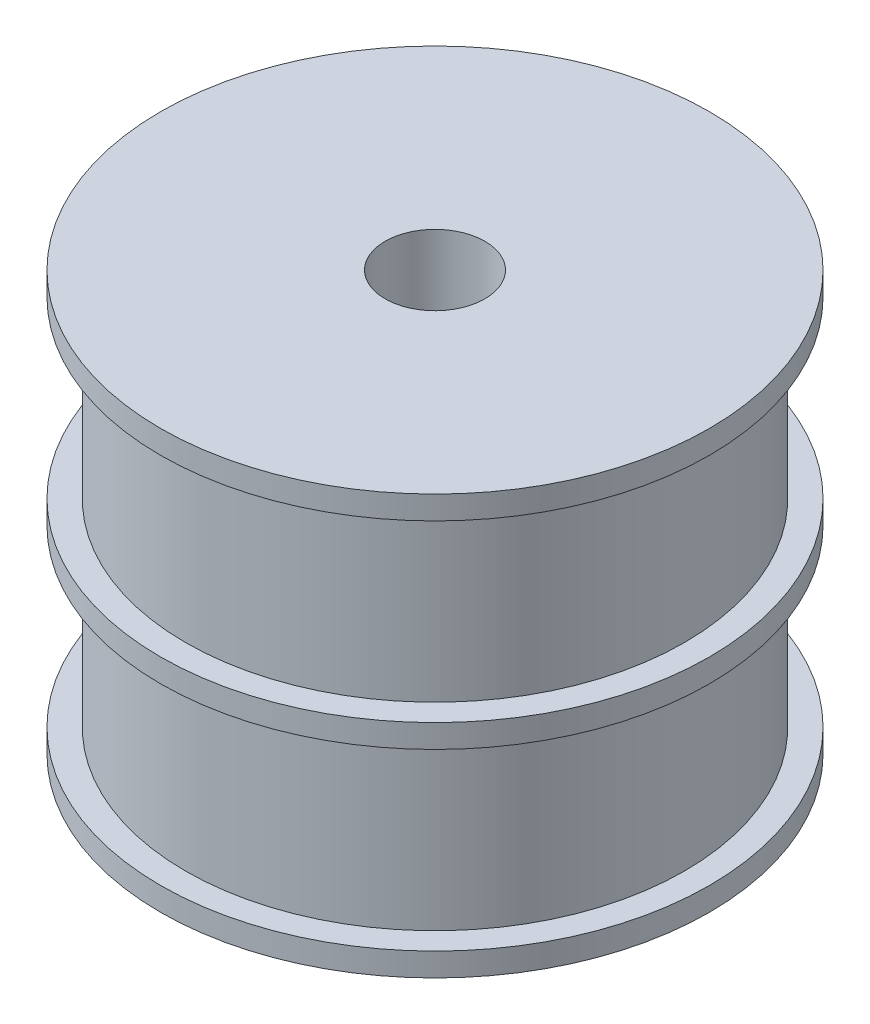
ISO-10303-21;
HEADER;
FILE_DESCRIPTION(('STEP AP214'),'2;1');
FILE_NAME('part.step','',(''),(''),'','','');
FILE_SCHEMA(('AUTOMOTIVE_DESIGN { 1 0 10303 214 1 1 1 1 }'));
ENDSEC;
DATA;
#1=APPLICATION_CONTEXT('core data for automotive mechanical design processes');
#2=APPLICATION_PROTOCOL_DEFINITION('international standard','automotive_design',2000,#1);
#3=PRODUCT_CONTEXT('',#1,'mechanical');
#4=PRODUCT('Part','Part','',(#3));
#5=PRODUCT_RELATED_PRODUCT_CATEGORY('part','',(#4));
#6=PRODUCT_DEFINITION_FORMATION('','',#4);
#7=PRODUCT_DEFINITION_CONTEXT('part definition',#1,'design');
#8=PRODUCT_DEFINITION('design','',#6,#7);
#9=PRODUCT_DEFINITION_SHAPE('','',#8);
#10=(LENGTH_UNIT() NAMED_UNIT(*) SI_UNIT(.MILLI.,.METRE.));
#11=(NAMED_UNIT(*) PLANE_ANGLE_UNIT() SI_UNIT($,.RADIAN.));
#12=(NAMED_UNIT(*) SI_UNIT($,.STERADIAN.) SOLID_ANGLE_UNIT());
#13=UNCERTAINTY_MEASURE_WITH_UNIT(LENGTH_MEASURE(1.E-05),#10,'distance_accuracy_value','');
#14=(GEOMETRIC_REPRESENTATION_CONTEXT(3) GLOBAL_UNCERTAINTY_ASSIGNED_CONTEXT((#13)) GLOBAL_UNIT_ASSIGNED_CONTEXT((#10,
#11,#12)) REPRESENTATION_CONTEXT('',''));
#15=CARTESIAN_POINT('',(0.,0.,0.));
#16=DIRECTION('',(0.,0.,1.));
#17=DIRECTION('',(1.,0.,0.));
#18=AXIS2_PLACEMENT_3D('',#15,#16,#17);
#19=CARTESIAN_POINT('',(0.,0.,0.));
#20=DIRECTION('',(0.,-1.,0.));
#21=DIRECTION('',(0.,0.,-1.));
#22=AXIS2_PLACEMENT_3D('',#19,#20,#21);
#23=CYLINDRICAL_SURFACE('',#22,5.5);
#24=CARTESIAN_POINT('',(0.,8.4,0.));
#25=DIRECTION('',(0.,-1.,0.));
#26=DIRECTION('',(0.,0.,-1.));
#27=AXIS2_PLACEMENT_3D('',#24,#25,#26);
#28=CIRCLE('',#27,5.5);
#29=CARTESIAN_POINT('',(0.,8.4,-5.5));
#30=VERTEX_POINT('',#29);
#31=EDGE_CURVE('E94',#30,#30,#28,.T.);
#32=ORIENTED_EDGE('',*,*,#31,.T.);
#33=EDGE_LOOP('',(#32));
#34=FACE_BOUND('',#33,.T.);
#35=CARTESIAN_POINT('',(0.,7.93333333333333,0.));
#36=DIRECTION('',(0.,-1.,0.));
#37=DIRECTION('',(0.,0.,-1.));
#38=AXIS2_PLACEMENT_3D('',#35,#36,#37);
#39=CIRCLE('',#38,5.5);
#40=CARTESIAN_POINT('',(0.,7.93333333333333,-5.5));
#41=VERTEX_POINT('',#40);
#42=EDGE_CURVE('E10',#41,#41,#39,.T.);
#43=ORIENTED_EDGE('',*,*,#42,.F.);
#44=EDGE_LOOP('',(#43));
#45=FACE_BOUND('',#44,.T.);
#46=ADVANCED_FACE('F43',(#34,#45),#23,.T.);
#47=CARTESIAN_POINT('',(5.5,7.93333333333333,0.));
#48=DIRECTION('',(0.,-1.,0.));
#49=DIRECTION('',(0.,0.,-1.));
#50=AXIS2_PLACEMENT_3D('',#47,#48,#49);
#51=PLANE('',#50);
#52=ORIENTED_EDGE('',*,*,#42,.T.);
#53=EDGE_LOOP('',(#52));
#54=FACE_BOUND('',#53,.T.);
#55=CARTESIAN_POINT('',(0.,7.93333333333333,0.));
#56=DIRECTION('',(0.,-1.,0.));
#57=DIRECTION('',(0.,0.,-1.));
#58=AXIS2_PLACEMENT_3D('',#55,#56,#57);
#59=CIRCLE('',#58,5.);
#60=CARTESIAN_POINT('',(0.,7.93333333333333,-5.));
#61=VERTEX_POINT('',#60);
#62=EDGE_CURVE('E50',#61,#61,#59,.T.);
#63=ORIENTED_EDGE('',*,*,#62,.F.);
#64=EDGE_LOOP('',(#63));
#65=FACE_BOUND('',#64,.T.);
#66=ADVANCED_FACE('F113',(#54,#65),#51,.T.);
#67=CARTESIAN_POINT('',(0.,0.,0.));
#68=DIRECTION('',(0.,-1.,0.));
#69=DIRECTION('',(0.,0.,-1.));
#70=AXIS2_PLACEMENT_3D('',#67,#68,#69);
#71=CYLINDRICAL_SURFACE('',#70,5.);
#72=ORIENTED_EDGE('',*,*,#62,.T.);
#73=EDGE_LOOP('',(#72));
#74=FACE_BOUND('',#73,.T.);
#75=CARTESIAN_POINT('',(0.,4.43333333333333,0.));
#76=DIRECTION('',(0.,-1.,0.));
#77=DIRECTION('',(0.,0.,-1.));
#78=AXIS2_PLACEMENT_3D('',#75,#76,#77);
#79=CIRCLE('',#78,5.);
#80=CARTESIAN_POINT('',(0.,4.43333333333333,-5.));
#81=VERTEX_POINT('',#80);
#82=EDGE_CURVE('E55',#81,#81,#79,.T.);
#83=ORIENTED_EDGE('',*,*,#82,.F.);
#84=EDGE_LOOP('',(#83));
#85=FACE_BOUND('',#84,.T.);
#86=ADVANCED_FACE('F117',(#74,#85),#71,.T.);
#87=CARTESIAN_POINT('',(5.,4.43333333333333,0.));
#88=DIRECTION('',(0.,1.,0.));
#89=DIRECTION('',(0.,0.,1.));
#90=AXIS2_PLACEMENT_3D('',#87,#88,#89);
#91=PLANE('',#90);
#92=ORIENTED_EDGE('',*,*,#82,.T.);
#93=EDGE_LOOP('',(#92));
#94=FACE_BOUND('',#93,.T.);
#95=CARTESIAN_POINT('',(0.,4.43333333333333,0.));
#96=DIRECTION('',(0.,-1.,0.));
#97=DIRECTION('',(0.,0.,-1.));
#98=AXIS2_PLACEMENT_3D('',#95,#96,#97);
#99=CIRCLE('',#98,5.5);
#100=CARTESIAN_POINT('',(0.,4.43333333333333,-5.5));
#101=VERTEX_POINT('',#100);
#102=EDGE_CURVE('E60',#101,#101,#99,.T.);
#103=ORIENTED_EDGE('',*,*,#102,.F.);
#104=EDGE_LOOP('',(#103));
#105=FACE_BOUND('',#104,.T.);
#106=ADVANCED_FACE('F121',(#94,#105),#91,.T.);
#107=CARTESIAN_POINT('',(0.,0.,0.));
#108=DIRECTION('',(0.,-1.,0.));
#109=DIRECTION('',(0.,0.,-1.));
#110=AXIS2_PLACEMENT_3D('',#107,#108,#109);
#111=CYLINDRICAL_SURFACE('',#110,5.5);
#112=ORIENTED_EDGE('',*,*,#102,.T.);
#113=EDGE_LOOP('',(#112));
#114=FACE_BOUND('',#113,.T.);
#115=CARTESIAN_POINT('',(0.,3.96666666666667,0.));
#116=DIRECTION('',(0.,-1.,0.));
#117=DIRECTION('',(0.,0.,-1.));
#118=AXIS2_PLACEMENT_3D('',#115,#116,#117);
#119=CIRCLE('',#118,5.5);
#120=CARTESIAN_POINT('',(0.,3.96666666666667,-5.5));
#121=VERTEX_POINT('',#120);
#122=EDGE_CURVE('E66',#121,#121,#119,.T.);
#123=ORIENTED_EDGE('',*,*,#122,.F.);
#124=EDGE_LOOP('',(#123));
#125=FACE_BOUND('',#124,.T.);
#126=ADVANCED_FACE('F127',(#114,#125),#111,.T.);
#127=CARTESIAN_POINT('',(5.5,3.96666666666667,0.));
#128=DIRECTION('',(0.,-1.,0.));
#129=DIRECTION('',(0.,0.,-1.));
#130=AXIS2_PLACEMENT_3D('',#127,#128,#129);
#131=PLANE('',#130);
#132=ORIENTED_EDGE('',*,*,#122,.T.);
#133=EDGE_LOOP('',(#132));
#134=FACE_BOUND('',#133,.T.);
#135=CARTESIAN_POINT('',(0.,3.96666666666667,0.));
#136=DIRECTION('',(0.,-1.,0.));
#137=DIRECTION('',(0.,0.,-1.));
#138=AXIS2_PLACEMENT_3D('',#135,#136,#137);
#139=CIRCLE('',#138,5.);
#140=CARTESIAN_POINT('',(0.,3.96666666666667,-5.));
#141=VERTEX_POINT('',#140);
#142=EDGE_CURVE('E70',#141,#141,#139,.T.);
#143=ORIENTED_EDGE('',*,*,#142,.F.);
#144=EDGE_LOOP('',(#143));
#145=FACE_BOUND('',#144,.T.);
#146=ADVANCED_FACE('F131',(#134,#145),#131,.T.);
#147=CARTESIAN_POINT('',(0.,0.,0.));
#148=DIRECTION('',(0.,-1.,0.));
#149=DIRECTION('',(0.,0.,-1.));
#150=AXIS2_PLACEMENT_3D('',#147,#148,#149);
#151=CYLINDRICAL_SURFACE('',#150,5.);
#152=ORIENTED_EDGE('',*,*,#142,.T.);
#153=EDGE_LOOP('',(#152));
#154=FACE_BOUND('',#153,.T.);
#155=CARTESIAN_POINT('',(0.,0.466666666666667,0.));
#156=DIRECTION('',(0.,-1.,0.));
#157=DIRECTION('',(0.,0.,-1.));
#158=AXIS2_PLACEMENT_3D('',#155,#156,#157);
#159=CIRCLE('',#158,5.);
#160=CARTESIAN_POINT('',(0.,0.466666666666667,-5.));
#161=VERTEX_POINT('',#160);
#162=EDGE_CURVE('E74',#161,#161,#159,.T.);
#163=ORIENTED_EDGE('',*,*,#162,.F.);
#164=EDGE_LOOP('',(#163));
#165=FACE_BOUND('',#164,.T.);
#166=ADVANCED_FACE('F135',(#154,#165),#151,.T.);
#167=CARTESIAN_POINT('',(5.,0.466666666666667,0.));
#168=DIRECTION('',(0.,1.,0.));
#169=DIRECTION('',(0.,0.,1.));
#170=AXIS2_PLACEMENT_3D('',#167,#168,#169);
#171=PLANE('',#170);
#172=ORIENTED_EDGE('',*,*,#162,.T.);
#173=EDGE_LOOP('',(#172));
#174=FACE_BOUND('',#173,.T.);
#175=CARTESIAN_POINT('',(0.,0.466666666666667,0.));
#176=DIRECTION('',(0.,-1.,0.));
#177=DIRECTION('',(0.,0.,-1.));
#178=AXIS2_PLACEMENT_3D('',#175,#176,#177);
#179=CIRCLE('',#178,5.5);
#180=CARTESIAN_POINT('',(0.,0.466666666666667,-5.5));
#181=VERTEX_POINT('',#180);
#182=EDGE_CURVE('E78',#181,#181,#179,.T.);
#183=ORIENTED_EDGE('',*,*,#182,.F.);
#184=EDGE_LOOP('',(#183));
#185=FACE_BOUND('',#184,.T.);
#186=ADVANCED_FACE('F139',(#174,#185),#171,.T.);
#187=CARTESIAN_POINT('',(0.,0.,0.));
#188=DIRECTION('',(0.,-1.,0.));
#189=DIRECTION('',(0.,0.,-1.));
#190=AXIS2_PLACEMENT_3D('',#187,#188,#189);
#191=CYLINDRICAL_SURFACE('',#190,5.5);
#192=ORIENTED_EDGE('',*,*,#182,.T.);
#193=EDGE_LOOP('',(#192));
#194=FACE_BOUND('',#193,.T.);
#195=CARTESIAN_POINT('',(0.,0.,0.));
#196=DIRECTION('',(0.,-1.,0.));
#197=DIRECTION('',(0.,0.,-1.));
#198=AXIS2_PLACEMENT_3D('',#195,#196,#197);
#199=CIRCLE('',#198,5.5);
#200=CARTESIAN_POINT('',(0.,0.,-5.5));
#201=VERTEX_POINT('',#200);
#202=EDGE_CURVE('E82',#201,#201,#199,.T.);
#203=ORIENTED_EDGE('',*,*,#202,.F.);
#204=EDGE_LOOP('',(#203));
#205=FACE_BOUND('',#204,.T.);
#206=ADVANCED_FACE('F143',(#194,#205),#191,.T.);
#207=CARTESIAN_POINT('',(5.5,0.,0.));
#208=DIRECTION('',(0.,-1.,0.));
#209=DIRECTION('',(0.,0.,-1.));
#210=AXIS2_PLACEMENT_3D('',#207,#208,#209);
#211=PLANE('',#210);
#212=ORIENTED_EDGE('',*,*,#202,.T.);
#213=EDGE_LOOP('',(#212));
#214=FACE_BOUND('',#213,.T.);
#215=CARTESIAN_POINT('',(0.,0.,0.));
#216=DIRECTION('',(0.,-1.,0.));
#217=DIRECTION('',(0.,0.,-1.));
#218=AXIS2_PLACEMENT_3D('',#215,#216,#217);
#219=CIRCLE('',#218,1.);
#220=CARTESIAN_POINT('',(0.,0.,-1.));
#221=VERTEX_POINT('',#220);
#222=EDGE_CURVE('E86',#221,#221,#219,.T.);
#223=ORIENTED_EDGE('',*,*,#222,.F.);
#224=EDGE_LOOP('',(#223));
#225=FACE_BOUND('',#224,.T.);
#226=ADVANCED_FACE('F109',(#214,#225),#211,.T.);
#227=CARTESIAN_POINT('',(0.,0.,0.));
#228=DIRECTION('',(0.,-1.,0.));
#229=DIRECTION('',(0.,0.,-1.));
#230=AXIS2_PLACEMENT_3D('',#227,#228,#229);
#231=CYLINDRICAL_SURFACE('',#230,1.);
#232=ORIENTED_EDGE('',*,*,#222,.T.);
#233=EDGE_LOOP('',(#232));
#234=FACE_BOUND('',#233,.T.);
#235=CARTESIAN_POINT('',(0.,8.4,0.));
#236=DIRECTION('',(0.,-1.,0.));
#237=DIRECTION('',(0.,0.,-1.));
#238=AXIS2_PLACEMENT_3D('',#235,#236,#237);
#239=CIRCLE('',#238,1.);
#240=CARTESIAN_POINT('',(0.,8.4,-1.));
#241=VERTEX_POINT('',#240);
#242=EDGE_CURVE('E90',#241,#241,#239,.T.);
#243=ORIENTED_EDGE('',*,*,#242,.F.);
#244=EDGE_LOOP('',(#243));
#245=FACE_BOUND('',#244,.T.);
#246=ADVANCED_FACE('F103',(#234,#245),#231,.F.);
#247=CARTESIAN_POINT('',(1.,8.4,0.));
#248=DIRECTION('',(0.,1.,0.));
#249=DIRECTION('',(0.,0.,1.));
#250=AXIS2_PLACEMENT_3D('',#247,#248,#249);
#251=PLANE('',#250);
#252=ORIENTED_EDGE('',*,*,#242,.T.);
#253=EDGE_LOOP('',(#252));
#254=FACE_BOUND('',#253,.T.);
#255=ORIENTED_EDGE('',*,*,#31,.F.);
#256=EDGE_LOOP('',(#255));
#257=FACE_BOUND('',#256,.T.);
#258=ADVANCED_FACE('F101',(#254,#257),#251,.T.);
#259=CLOSED_SHELL('',(#46,#66,#86,#106,#126,#146,#166,#186,#206,#226,#246,#258));
#260=MANIFOLD_SOLID_BREP('B2',#259);
#261=ADVANCED_BREP_SHAPE_REPRESENTATION('',(#18,#260),#14);
#262=SHAPE_DEFINITION_REPRESENTATION(#9,#261);
ENDSEC;
END-ISO-10303-21;
